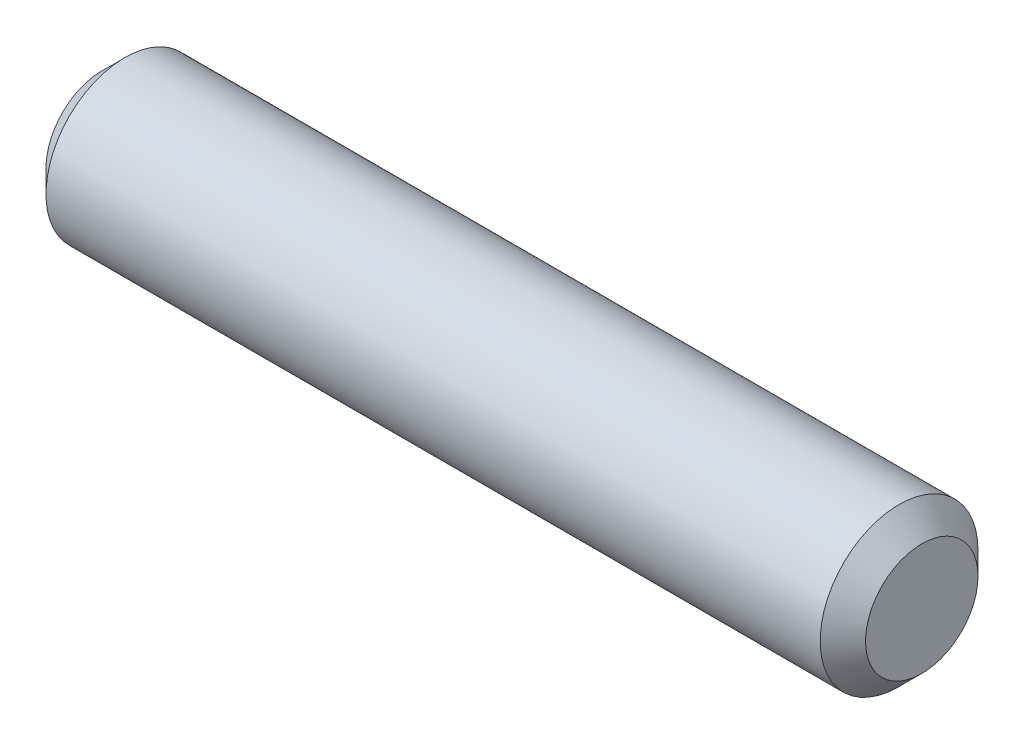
ISO-10303-21;
HEADER;
FILE_DESCRIPTION(('STEP AP214'),'2;1');
FILE_NAME('part.step','',(''),(''),'','','');
FILE_SCHEMA(('AUTOMOTIVE_DESIGN { 1 0 10303 214 1 1 1 1 }'));
ENDSEC;
DATA;
#1=APPLICATION_CONTEXT('core data for automotive mechanical design processes');
#2=APPLICATION_PROTOCOL_DEFINITION('international standard','automotive_design',2000,#1);
#3=PRODUCT_CONTEXT('',#1,'mechanical');
#4=PRODUCT('Part','Part','',(#3));
#5=PRODUCT_RELATED_PRODUCT_CATEGORY('part','',(#4));
#6=PRODUCT_DEFINITION_FORMATION('','',#4);
#7=PRODUCT_DEFINITION_CONTEXT('part definition',#1,'design');
#8=PRODUCT_DEFINITION('design','',#6,#7);
#9=PRODUCT_DEFINITION_SHAPE('','',#8);
#10=(LENGTH_UNIT() NAMED_UNIT(*) SI_UNIT(.MILLI.,.METRE.));
#11=(NAMED_UNIT(*) PLANE_ANGLE_UNIT() SI_UNIT($,.RADIAN.));
#12=(NAMED_UNIT(*) SI_UNIT($,.STERADIAN.) SOLID_ANGLE_UNIT());
#13=UNCERTAINTY_MEASURE_WITH_UNIT(LENGTH_MEASURE(1.E-05),#10,'distance_accuracy_value','');
#14=(GEOMETRIC_REPRESENTATION_CONTEXT(3) GLOBAL_UNCERTAINTY_ASSIGNED_CONTEXT((#13)) GLOBAL_UNIT_ASSIGNED_CONTEXT((#10,
#11,#12)) REPRESENTATION_CONTEXT('',''));
#15=CARTESIAN_POINT('',(0.,0.,0.));
#16=DIRECTION('',(0.,0.,1.));
#17=DIRECTION('',(1.,0.,0.));
#18=AXIS2_PLACEMENT_3D('',#15,#16,#17);
#19=CARTESIAN_POINT('',(20.6375,0.,0.));
#20=DIRECTION('',(-1.,0.,0.));
#21=DIRECTION('',(0.,0.,1.));
#22=AXIS2_PLACEMENT_3D('',#19,#20,#21);
#23=CYLINDRICAL_SURFACE('',#22,3.97383);
#24=CARTESIAN_POINT('',(-19.4945,0.,0.));
#25=DIRECTION('',(1.,0.,0.));
#26=DIRECTION('',(0.,0.,-1.));
#27=AXIS2_PLACEMENT_3D('',#24,#25,#26);
#28=CIRCLE('',#27,3.97383);
#29=CARTESIAN_POINT('',(-19.4945,0.,-3.97383));
#30=VERTEX_POINT('',#29);
#31=EDGE_CURVE('E41',#30,#30,#28,.T.);
#32=ORIENTED_EDGE('',*,*,#31,.T.);
#33=EDGE_LOOP('',(#32));
#34=FACE_BOUND('',#33,.T.);
#35=CARTESIAN_POINT('',(19.4945,0.,0.));
#36=DIRECTION('',(1.,0.,0.));
#37=DIRECTION('',(0.,0.,-1.));
#38=AXIS2_PLACEMENT_3D('',#35,#36,#37);
#39=CIRCLE('',#38,3.97383);
#40=CARTESIAN_POINT('',(19.4945,0.,-3.97383));
#41=VERTEX_POINT('',#40);
#42=EDGE_CURVE('E45',#41,#41,#39,.F.);
#43=ORIENTED_EDGE('',*,*,#42,.T.);
#44=EDGE_LOOP('',(#43));
#45=FACE_BOUND('',#44,.T.);
#46=ADVANCED_FACE('F30',(#34,#45),#23,.T.);
#47=CARTESIAN_POINT('',(20.6375,0.,0.));
#48=DIRECTION('',(1.,0.,0.));
#49=DIRECTION('',(0.,0.,-1.));
#50=AXIS2_PLACEMENT_3D('',#47,#48,#49);
#51=PLANE('',#50);
#52=CARTESIAN_POINT('',(20.6375,0.,0.));
#53=DIRECTION('',(1.,0.,0.));
#54=DIRECTION('',(0.,0.,-1.));
#55=AXIS2_PLACEMENT_3D('',#52,#53,#54);
#56=CIRCLE('',#55,2.83083);
#57=CARTESIAN_POINT('',(20.6375,0.,-2.83083));
#58=VERTEX_POINT('',#57);
#59=EDGE_CURVE('E10',#58,#58,#56,.T.);
#60=ORIENTED_EDGE('',*,*,#59,.T.);
#61=EDGE_LOOP('',(#60));
#62=FACE_BOUND('',#61,.T.);
#63=ADVANCED_FACE('F61',(#62),#51,.T.);
#64=CARTESIAN_POINT('',(-20.6375,0.,0.));
#65=DIRECTION('',(1.,0.,0.));
#66=DIRECTION('',(0.,0.,-1.));
#67=AXIS2_PLACEMENT_3D('',#64,#65,#66);
#68=PLANE('',#67);
#69=CARTESIAN_POINT('',(-20.6375,0.,0.));
#70=DIRECTION('',(1.,0.,0.));
#71=DIRECTION('',(0.,0.,-1.));
#72=AXIS2_PLACEMENT_3D('',#69,#70,#71);
#73=CIRCLE('',#72,2.83083);
#74=CARTESIAN_POINT('',(-20.6375,0.,-2.83083));
#75=VERTEX_POINT('',#74);
#76=EDGE_CURVE('E37',#75,#75,#73,.F.);
#77=ORIENTED_EDGE('',*,*,#76,.T.);
#78=EDGE_LOOP('',(#77));
#79=FACE_BOUND('',#78,.T.);
#80=ADVANCED_FACE('F58',(#79),#68,.F.);
#81=CARTESIAN_POINT('',(-19.4945,0.,0.));
#82=DIRECTION('',(1.,0.,0.));
#83=DIRECTION('',(0.,0.,-1.));
#84=AXIS2_PLACEMENT_3D('',#81,#82,#83);
#85=CONICAL_SURFACE('',#84,3.97383,0.78539816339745);
#86=ORIENTED_EDGE('',*,*,#76,.F.);
#87=EDGE_LOOP('',(#86));
#88=FACE_BOUND('',#87,.T.);
#89=ORIENTED_EDGE('',*,*,#31,.F.);
#90=EDGE_LOOP('',(#89));
#91=FACE_BOUND('',#90,.T.);
#92=ADVANCED_FACE('F54',(#88,#91),#85,.T.);
#93=CARTESIAN_POINT('',(20.6375,0.,0.));
#94=DIRECTION('',(-1.,0.,0.));
#95=DIRECTION('',(0.,0.,1.));
#96=AXIS2_PLACEMENT_3D('',#93,#94,#95);
#97=CONICAL_SURFACE('',#96,2.83083,0.785398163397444);
#98=ORIENTED_EDGE('',*,*,#42,.F.);
#99=EDGE_LOOP('',(#98));
#100=FACE_BOUND('',#99,.T.);
#101=ORIENTED_EDGE('',*,*,#59,.F.);
#102=EDGE_LOOP('',(#101));
#103=FACE_BOUND('',#102,.T.);
#104=ADVANCED_FACE('F32',(#100,#103),#97,.T.);
#105=CLOSED_SHELL('',(#46,#63,#80,#92,#104));
#106=MANIFOLD_SOLID_BREP('B2',#105);
#107=ADVANCED_BREP_SHAPE_REPRESENTATION('',(#18,#106),#14);
#108=SHAPE_DEFINITION_REPRESENTATION(#9,#107);
ENDSEC;
END-ISO-10303-21;
